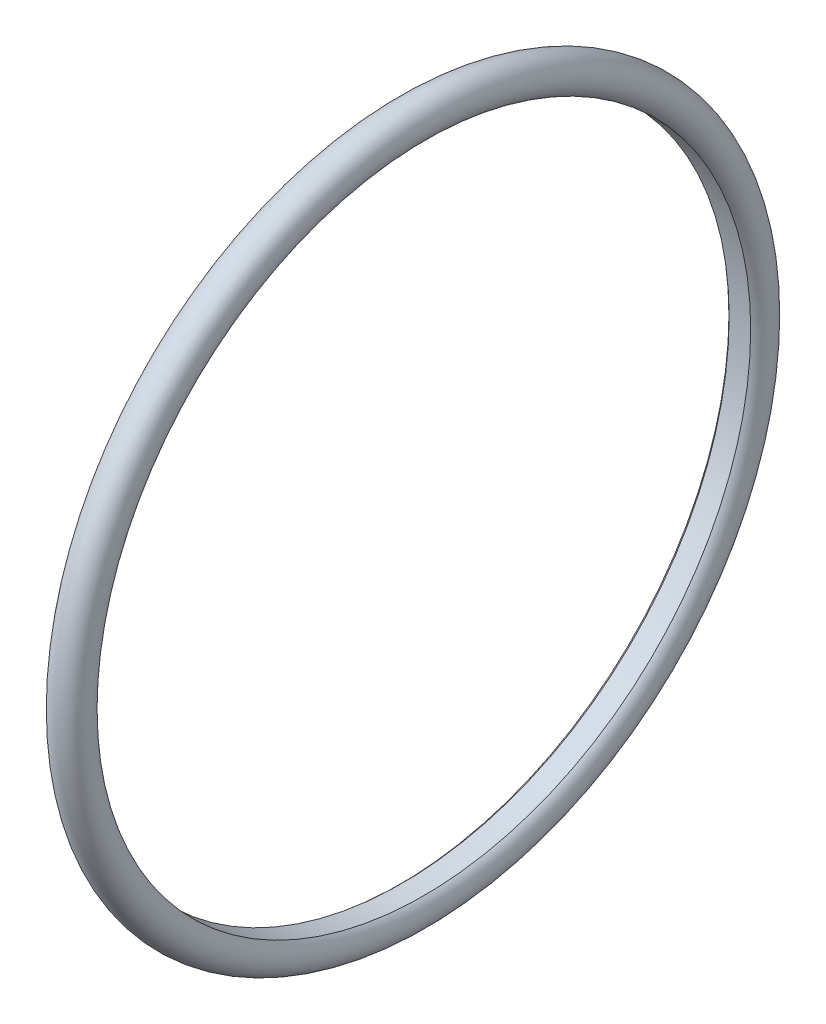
from build123d import *

# Parameters (mm, degrees)
ESQUISSE1_R                  = 0.5
ENL_V_MAT_EXTRU_1_DEPTH      = 15.150971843
ENL_V_MAT_EXTRU_1_DEPTH_BACK = 15.150971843
ESQUISSE2_R                  = 9.1


with BuildPart() as part:
    # Esquisse1 → R_volution1 (revolve)
    with BuildSketch(Plane.XY, mode=Mode.PRIVATE) as r_volution1_sk:
        with Locations((0, 9.5)):
            Circle(ESQUISSE1_R)
    revolve(r_volution1_sk.sketch.rotate(Axis((0, 0, 0), (1, 0, 0)), 90), axis=Axis((0, 0, 0), (1, 0, 0)))

    # Esquisse2 → Enl_v. mat.-Extru.1 (cut, two sides: drawn at the far end of the back side and taken through both)
    with BuildSketch(Plane(origin=(0, 0, 0), x_dir=(0, 0, -1), z_dir=(1, 0, 0)).offset(-ENL_V_MAT_EXTRU_1_DEPTH_BACK)):
        with Locations(Location((0, 0, 0), (0, 0, 180))):
            Circle(ESQUISSE2_R)
    extrude(amount=ENL_V_MAT_EXTRU_1_DEPTH + ENL_V_MAT_EXTRU_1_DEPTH_BACK, mode=Mode.SUBTRACT)


solid = part.part
